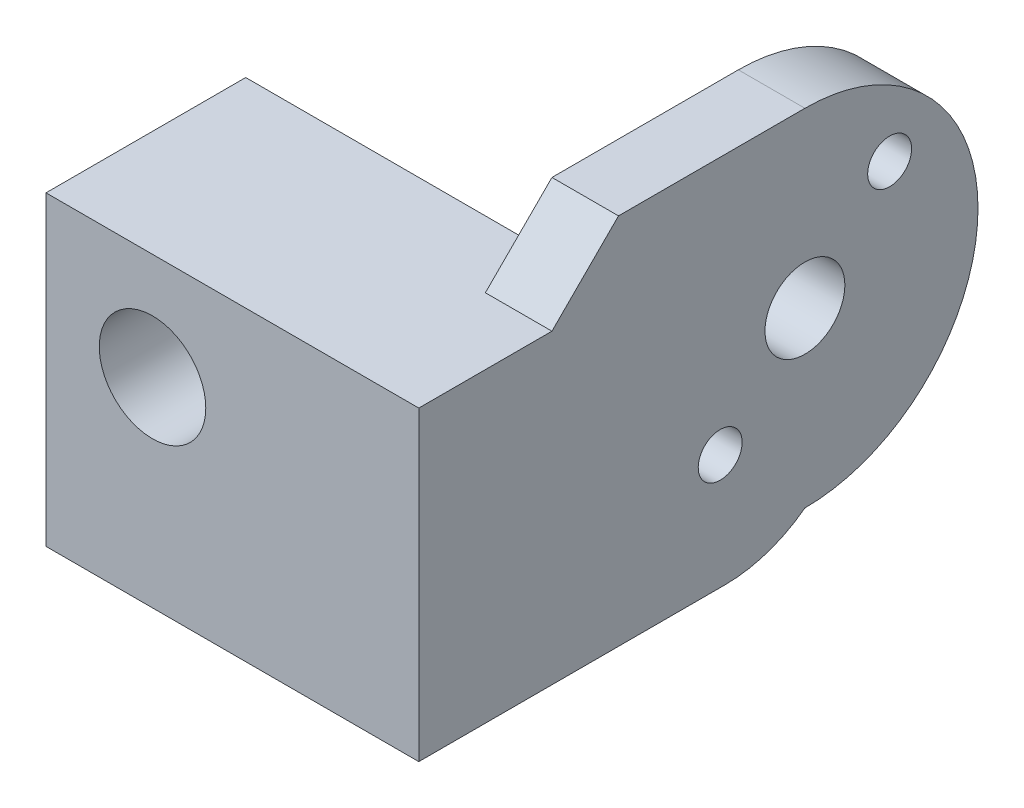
ISO-10303-21;
HEADER;
FILE_DESCRIPTION(('STEP AP214'),'2;1');
FILE_NAME('part.step','',(''),(''),'','','');
FILE_SCHEMA(('AUTOMOTIVE_DESIGN { 1 0 10303 214 1 1 1 1 }'));
ENDSEC;
DATA;
#1=APPLICATION_CONTEXT('core data for automotive mechanical design processes');
#2=APPLICATION_PROTOCOL_DEFINITION('international standard','automotive_design',2000,#1);
#3=PRODUCT_CONTEXT('',#1,'mechanical');
#4=PRODUCT('Part','Part','',(#3));
#5=PRODUCT_RELATED_PRODUCT_CATEGORY('part','',(#4));
#6=PRODUCT_DEFINITION_FORMATION('','',#4);
#7=PRODUCT_DEFINITION_CONTEXT('part definition',#1,'design');
#8=PRODUCT_DEFINITION('design','',#6,#7);
#9=PRODUCT_DEFINITION_SHAPE('','',#8);
#10=(LENGTH_UNIT() NAMED_UNIT(*) SI_UNIT(.MILLI.,.METRE.));
#11=(NAMED_UNIT(*) PLANE_ANGLE_UNIT() SI_UNIT($,.RADIAN.));
#12=(NAMED_UNIT(*) SI_UNIT($,.STERADIAN.) SOLID_ANGLE_UNIT());
#13=UNCERTAINTY_MEASURE_WITH_UNIT(LENGTH_MEASURE(1.E-05),#10,'distance_accuracy_value','');
#14=(GEOMETRIC_REPRESENTATION_CONTEXT(3) GLOBAL_UNCERTAINTY_ASSIGNED_CONTEXT((#13)) GLOBAL_UNIT_ASSIGNED_CONTEXT((#10,
#11,#12)) REPRESENTATION_CONTEXT('',''));
#15=CARTESIAN_POINT('',(0.,0.,0.));
#16=DIRECTION('',(0.,0.,1.));
#17=DIRECTION('',(1.,0.,0.));
#18=AXIS2_PLACEMENT_3D('',#15,#16,#17);
#19=CARTESIAN_POINT('',(0.,0.,-5.));
#20=DIRECTION('',(0.,0.,-1.));
#21=DIRECTION('',(-1.,0.,0.));
#22=AXIS2_PLACEMENT_3D('',#19,#20,#21);
#23=PLANE('',#22);
#24=DIRECTION('',(1.,0.,0.));
#25=VECTOR('',#24,1.);
#26=CARTESIAN_POINT('',(-8.,8.,-5.));
#27=LINE('',#26,#25);
#28=CARTESIAN_POINT('',(-8.,8.,-5.));
#29=VERTEX_POINT('',#28);
#30=CARTESIAN_POINT('',(15.,8.,-5.));
#31=VERTEX_POINT('',#30);
#32=EDGE_CURVE('E161',#29,#31,#27,.T.);
#33=ORIENTED_EDGE('',*,*,#32,.T.);
#34=DIRECTION('',(0.,-1.,0.));
#35=VECTOR('',#34,1.);
#36=CARTESIAN_POINT('',(15.,-15.,-5.));
#37=LINE('',#36,#35);
#38=CARTESIAN_POINT('',(15.,-15.,-5.));
#39=VERTEX_POINT('',#38);
#40=EDGE_CURVE('E147',#31,#39,#37,.T.);
#41=ORIENTED_EDGE('',*,*,#40,.T.);
#42=DIRECTION('',(-1.,0.,0.));
#43=VECTOR('',#42,1.);
#44=CARTESIAN_POINT('',(20.,-15.,-5.));
#45=LINE('',#44,#43);
#46=CARTESIAN_POINT('',(-8.,-15.,-5.));
#47=VERTEX_POINT('',#46);
#48=EDGE_CURVE('E167',#39,#47,#45,.T.);
#49=ORIENTED_EDGE('',*,*,#48,.T.);
#50=DIRECTION('',(0.,1.,0.));
#51=VECTOR('',#50,1.);
#52=CARTESIAN_POINT('',(-8.,-15.,-5.));
#53=LINE('',#52,#51);
#54=EDGE_CURVE('E170',#47,#29,#53,.T.);
#55=ORIENTED_EDGE('',*,*,#54,.T.);
#56=EDGE_LOOP('',(#33,#41,#49,#55));
#57=FACE_BOUND('',#56,.T.);
#58=ADVANCED_FACE('F41',(#57),#23,.T.);
#59=CARTESIAN_POINT('',(0.,0.,10.));
#60=DIRECTION('',(0.,0.,-1.));
#61=DIRECTION('',(-1.,0.,0.));
#62=AXIS2_PLACEMENT_3D('',#59,#60,#61);
#63=PLANE('',#62);
#64=DIRECTION('',(0.,1.,0.));
#65=VECTOR('',#64,1.);
#66=CARTESIAN_POINT('',(20.,8.,10.));
#67=LINE('',#66,#65);
#68=CARTESIAN_POINT('',(20.,-15.,10.));
#69=VERTEX_POINT('',#68);
#70=CARTESIAN_POINT('',(20.,8.,10.));
#71=VERTEX_POINT('',#70);
#72=EDGE_CURVE('E179',#69,#71,#67,.T.);
#73=ORIENTED_EDGE('',*,*,#72,.T.);
#74=DIRECTION('',(-1.,0.,0.));
#75=VECTOR('',#74,1.);
#76=CARTESIAN_POINT('',(20.,8.,10.));
#77=LINE('',#76,#75);
#78=CARTESIAN_POINT('',(-8.,8.,10.));
#79=VERTEX_POINT('',#78);
#80=EDGE_CURVE('E186',#71,#79,#77,.T.);
#81=ORIENTED_EDGE('',*,*,#80,.T.);
#82=DIRECTION('',(0.,-1.,0.));
#83=VECTOR('',#82,1.);
#84=CARTESIAN_POINT('',(-8.,8.,10.));
#85=LINE('',#84,#83);
#86=CARTESIAN_POINT('',(-8.,-15.,10.));
#87=VERTEX_POINT('',#86);
#88=EDGE_CURVE('E189',#79,#87,#85,.T.);
#89=ORIENTED_EDGE('',*,*,#88,.T.);
#90=DIRECTION('',(1.,0.,0.));
#91=VECTOR('',#90,1.);
#92=CARTESIAN_POINT('',(20.,-15.,10.));
#93=LINE('',#92,#91);
#94=EDGE_CURVE('E192',#87,#69,#93,.T.);
#95=ORIENTED_EDGE('',*,*,#94,.T.);
#96=EDGE_LOOP('',(#73,#81,#89,#95));
#97=FACE_BOUND('',#96,.T.);
#98=CARTESIAN_POINT('',(0.,0.,10.));
#99=DIRECTION('',(0.,0.,1.));
#100=DIRECTION('',(1.,0.,0.));
#101=AXIS2_PLACEMENT_3D('',#98,#99,#100);
#102=CIRCLE('',#101,4.);
#103=CARTESIAN_POINT('',(4.,0.,10.));
#104=VERTEX_POINT('',#103);
#105=EDGE_CURVE('E175',#104,#104,#102,.T.);
#106=ORIENTED_EDGE('',*,*,#105,.F.);
#107=EDGE_LOOP('',(#106));
#108=FACE_BOUND('',#107,.T.);
#109=ADVANCED_FACE('F245',(#97,#108),#63,.F.);
#110=CARTESIAN_POINT('',(20.,8.,10.));
#111=DIRECTION('',(-1.,0.,0.));
#112=DIRECTION('',(0.,-1.,0.));
#113=AXIS2_PLACEMENT_3D('',#110,#111,#112);
#114=PLANE('',#113);
#115=CARTESIAN_POINT('',(20.,6.36396103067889,-25.363961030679));
#116=DIRECTION('',(-1.,0.,0.));
#117=DIRECTION('',(0.,-1.,0.));
#118=AXIS2_PLACEMENT_3D('',#115,#116,#117);
#119=CIRCLE('',#118,1.65);
#120=CARTESIAN_POINT('',(20.,4.71396103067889,-25.363961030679));
#121=VERTEX_POINT('',#120);
#122=EDGE_CURVE('E291',#121,#121,#119,.T.);
#123=ORIENTED_EDGE('',*,*,#122,.T.);
#124=EDGE_LOOP('',(#123));
#125=FACE_BOUND('',#124,.T.);
#126=CARTESIAN_POINT('',(20.,-6.3639610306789,-12.636038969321));
#127=DIRECTION('',(-1.,0.,0.));
#128=DIRECTION('',(0.,-1.,0.));
#129=AXIS2_PLACEMENT_3D('',#126,#127,#128);
#130=CIRCLE('',#129,1.65);
#131=CARTESIAN_POINT('',(20.,-8.0139610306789,-12.636038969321));
#132=VERTEX_POINT('',#131);
#133=EDGE_CURVE('E296',#132,#132,#130,.T.);
#134=ORIENTED_EDGE('',*,*,#133,.T.);
#135=EDGE_LOOP('',(#134));
#136=FACE_BOUND('',#135,.T.);
#137=DIRECTION('',(0.,0.,-1.));
#138=VECTOR('',#137,1.);
#139=CARTESIAN_POINT('',(20.,-15.,10.));
#140=LINE('',#139,#138);
#141=CARTESIAN_POINT('',(20.,-15.,-13.));
#142=VERTEX_POINT('',#141);
#143=EDGE_CURVE('E195',#69,#142,#140,.T.);
#144=ORIENTED_EDGE('',*,*,#143,.T.);
#145=CARTESIAN_POINT('',(20.,-5.,-13.));
#146=DIRECTION('',(-1.,0.,0.));
#147=DIRECTION('',(0.,-1.,0.));
#148=AXIS2_PLACEMENT_3D('',#145,#146,#147);
#149=CIRCLE('',#148,10.);
#150=CARTESIAN_POINT('',(20.,-13.,-19.));
#151=VERTEX_POINT('',#150);
#152=EDGE_CURVE('E211',#142,#151,#149,.F.);
#153=ORIENTED_EDGE('',*,*,#152,.T.);
#154=CARTESIAN_POINT('',(20.,0.,-19.));
#155=DIRECTION('',(1.,0.,0.));
#156=DIRECTION('',(0.,-1.,0.));
#157=AXIS2_PLACEMENT_3D('',#154,#155,#156);
#158=CIRCLE('',#157,13.);
#159=CARTESIAN_POINT('',(20.,13.,-19.));
#160=VERTEX_POINT('',#159);
#161=EDGE_CURVE('E141',#151,#160,#158,.T.);
#162=ORIENTED_EDGE('',*,*,#161,.T.);
#163=DIRECTION('',(0.,0.,1.));
#164=VECTOR('',#163,1.);
#165=CARTESIAN_POINT('',(20.,13.,-5.));
#166=LINE('',#165,#164);
#167=CARTESIAN_POINT('',(20.,13.,-5.));
#168=VERTEX_POINT('',#167);
#169=EDGE_CURVE('E119',#160,#168,#166,.T.);
#170=ORIENTED_EDGE('',*,*,#169,.T.);
#171=DIRECTION('',(0.,-0.707106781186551,0.707106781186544));
#172=VECTOR('',#171,1.);
#173=CARTESIAN_POINT('',(20.,2.99999999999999,4.99999999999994));
#174=LINE('',#173,#172);
#175=CARTESIAN_POINT('',(20.,8.,0.));
#176=VERTEX_POINT('',#175);
#177=EDGE_CURVE('E51',#168,#176,#174,.T.);
#178=ORIENTED_EDGE('',*,*,#177,.T.);
#179=DIRECTION('',(0.,0.,-1.));
#180=VECTOR('',#179,1.);
#181=CARTESIAN_POINT('',(20.,8.,10.));
#182=LINE('',#181,#180);
#183=EDGE_CURVE('E152',#71,#176,#182,.T.);
#184=ORIENTED_EDGE('',*,*,#183,.F.);
#185=ORIENTED_EDGE('',*,*,#72,.F.);
#186=EDGE_LOOP('',(#144,#153,#162,#170,#178,#184,#185));
#187=FACE_BOUND('',#186,.T.);
#188=CARTESIAN_POINT('',(20.,0.,-19.));
#189=DIRECTION('',(1.,0.,0.));
#190=DIRECTION('',(0.,1.,0.));
#191=AXIS2_PLACEMENT_3D('',#188,#189,#190);
#192=CIRCLE('',#191,3.);
#193=CARTESIAN_POINT('',(20.,3.,-19.));
#194=VERTEX_POINT('',#193);
#195=EDGE_CURVE('E144',#194,#194,#192,.T.);
#196=ORIENTED_EDGE('',*,*,#195,.F.);
#197=EDGE_LOOP('',(#196));
#198=FACE_BOUND('',#197,.T.);
#199=ADVANCED_FACE('F227',(#125,#136,#187,#198),#114,.F.);
#200=CARTESIAN_POINT('',(20.,8.,10.));
#201=DIRECTION('',(0.,-1.,0.));
#202=DIRECTION('',(1.,0.,0.));
#203=AXIS2_PLACEMENT_3D('',#200,#201,#202);
#204=PLANE('',#203);
#205=ORIENTED_EDGE('',*,*,#183,.T.);
#206=DIRECTION('',(-1.,0.,0.));
#207=VECTOR('',#206,1.);
#208=CARTESIAN_POINT('',(20.,8.,0.));
#209=LINE('',#208,#207);
#210=CARTESIAN_POINT('',(15.,8.,0.));
#211=VERTEX_POINT('',#210);
#212=EDGE_CURVE('E219',#176,#211,#209,.T.);
#213=ORIENTED_EDGE('',*,*,#212,.T.);
#214=DIRECTION('',(0.,0.,-1.));
#215=VECTOR('',#214,1.);
#216=CARTESIAN_POINT('',(15.,8.,10.));
#217=LINE('',#216,#215);
#218=EDGE_CURVE('E57',#211,#31,#217,.T.);
#219=ORIENTED_EDGE('',*,*,#218,.T.);
#220=ORIENTED_EDGE('',*,*,#32,.F.);
#221=DIRECTION('',(0.,0.,-1.));
#222=VECTOR('',#221,1.);
#223=CARTESIAN_POINT('',(-8.,8.,10.));
#224=LINE('',#223,#222);
#225=EDGE_CURVE('E203',#79,#29,#224,.T.);
#226=ORIENTED_EDGE('',*,*,#225,.F.);
#227=ORIENTED_EDGE('',*,*,#80,.F.);
#228=EDGE_LOOP('',(#205,#213,#219,#220,#226,#227));
#229=FACE_BOUND('',#228,.T.);
#230=ADVANCED_FACE('F224',(#229),#204,.F.);
#231=CARTESIAN_POINT('',(-8.,8.,10.));
#232=DIRECTION('',(1.,0.,0.));
#233=DIRECTION('',(0.,1.,0.));
#234=AXIS2_PLACEMENT_3D('',#231,#232,#233);
#235=PLANE('',#234);
#236=ORIENTED_EDGE('',*,*,#225,.T.);
#237=ORIENTED_EDGE('',*,*,#54,.F.);
#238=DIRECTION('',(0.,0.,-1.));
#239=VECTOR('',#238,1.);
#240=CARTESIAN_POINT('',(-8.,-15.,10.));
#241=LINE('',#240,#239);
#242=EDGE_CURVE('E199',#87,#47,#241,.T.);
#243=ORIENTED_EDGE('',*,*,#242,.F.);
#244=ORIENTED_EDGE('',*,*,#88,.F.);
#245=EDGE_LOOP('',(#236,#237,#243,#244));
#246=FACE_BOUND('',#245,.T.);
#247=ADVANCED_FACE('F243',(#246),#235,.F.);
#248=CARTESIAN_POINT('',(20.,-15.,10.));
#249=DIRECTION('',(0.,1.,0.));
#250=DIRECTION('',(-1.,0.,0.));
#251=AXIS2_PLACEMENT_3D('',#248,#249,#250);
#252=PLANE('',#251);
#253=DIRECTION('',(0.,0.,-1.));
#254=VECTOR('',#253,1.);
#255=CARTESIAN_POINT('',(15.,-15.,-19.));
#256=LINE('',#255,#254);
#257=CARTESIAN_POINT('',(15.,-15.,-13.));
#258=VERTEX_POINT('',#257);
#259=EDGE_CURVE('E126',#39,#258,#256,.T.);
#260=ORIENTED_EDGE('',*,*,#259,.T.);
#261=DIRECTION('',(1.,0.,0.));
#262=VECTOR('',#261,1.);
#263=CARTESIAN_POINT('',(20.,-15.,-13.));
#264=LINE('',#263,#262);
#265=EDGE_CURVE('E151',#258,#142,#264,.T.);
#266=ORIENTED_EDGE('',*,*,#265,.T.);
#267=ORIENTED_EDGE('',*,*,#143,.F.);
#268=ORIENTED_EDGE('',*,*,#94,.F.);
#269=ORIENTED_EDGE('',*,*,#242,.T.);
#270=ORIENTED_EDGE('',*,*,#48,.F.);
#271=EDGE_LOOP('',(#260,#266,#267,#268,#269,#270));
#272=FACE_BOUND('',#271,.T.);
#273=ADVANCED_FACE('F234',(#272),#252,.F.);
#274=CARTESIAN_POINT('',(0.,0.,10.));
#275=DIRECTION('',(0.,0.,-1.));
#276=DIRECTION('',(-1.,0.,0.));
#277=AXIS2_PLACEMENT_3D('',#274,#275,#276);
#278=CYLINDRICAL_SURFACE('',#277,4.);
#279=ORIENTED_EDGE('',*,*,#105,.T.);
#280=EDGE_LOOP('',(#279));
#281=FACE_BOUND('',#280,.T.);
#282=CARTESIAN_POINT('',(0.,0.,0.));
#283=DIRECTION('',(0.,0.,1.));
#284=DIRECTION('',(1.,0.,0.));
#285=AXIS2_PLACEMENT_3D('',#282,#283,#284);
#286=CIRCLE('',#285,4.);
#287=CARTESIAN_POINT('',(4.,0.,0.));
#288=VERTEX_POINT('',#287);
#289=EDGE_CURVE('E174',#288,#288,#286,.T.);
#290=ORIENTED_EDGE('',*,*,#289,.F.);
#291=EDGE_LOOP('',(#290));
#292=FACE_BOUND('',#291,.T.);
#293=ADVANCED_FACE('F252',(#281,#292),#278,.F.);
#294=CARTESIAN_POINT('',(0.,0.,0.));
#295=DIRECTION('',(0.,0.,-1.));
#296=DIRECTION('',(-1.,0.,0.));
#297=AXIS2_PLACEMENT_3D('',#294,#295,#296);
#298=PLANE('',#297);
#299=ORIENTED_EDGE('',*,*,#289,.T.);
#300=EDGE_LOOP('',(#299));
#301=FACE_BOUND('',#300,.T.);
#302=ADVANCED_FACE('F255',(#301),#298,.F.);
#303=CARTESIAN_POINT('',(15.,0.,-19.));
#304=DIRECTION('',(1.,0.,0.));
#305=DIRECTION('',(0.,1.,0.));
#306=AXIS2_PLACEMENT_3D('',#303,#304,#305);
#307=CYLINDRICAL_SURFACE('',#306,13.);
#308=ORIENTED_EDGE('',*,*,#161,.F.);
#309=DIRECTION('',(1.,0.,0.));
#310=VECTOR('',#309,1.);
#311=CARTESIAN_POINT('',(15.,-13.,-19.));
#312=LINE('',#311,#310);
#313=CARTESIAN_POINT('',(15.,-13.,-19.));
#314=VERTEX_POINT('',#313);
#315=EDGE_CURVE('E137',#314,#151,#312,.T.);
#316=ORIENTED_EDGE('',*,*,#315,.F.);
#317=CARTESIAN_POINT('',(15.,0.,-19.));
#318=DIRECTION('',(1.,0.,0.));
#319=DIRECTION('',(0.,-1.,0.));
#320=AXIS2_PLACEMENT_3D('',#317,#318,#319);
#321=CIRCLE('',#320,13.);
#322=CARTESIAN_POINT('',(15.,13.,-19.));
#323=VERTEX_POINT('',#322);
#324=EDGE_CURVE('E130',#314,#323,#321,.T.);
#325=ORIENTED_EDGE('',*,*,#324,.T.);
#326=DIRECTION('',(1.,0.,0.));
#327=VECTOR('',#326,1.);
#328=CARTESIAN_POINT('',(15.,13.,-19.));
#329=LINE('',#328,#327);
#330=EDGE_CURVE('E113',#323,#160,#329,.T.);
#331=ORIENTED_EDGE('',*,*,#330,.T.);
#332=EDGE_LOOP('',(#308,#316,#325,#331));
#333=FACE_BOUND('',#332,.T.);
#334=ADVANCED_FACE('F135',(#333),#307,.T.);
#335=CARTESIAN_POINT('',(15.,13.,-5.));
#336=DIRECTION('',(0.,1.,0.));
#337=DIRECTION('',(-1.,0.,0.));
#338=AXIS2_PLACEMENT_3D('',#335,#336,#337);
#339=PLANE('',#338);
#340=ORIENTED_EDGE('',*,*,#169,.F.);
#341=ORIENTED_EDGE('',*,*,#330,.F.);
#342=DIRECTION('',(0.,0.,1.));
#343=VECTOR('',#342,1.);
#344=CARTESIAN_POINT('',(15.,13.,-5.));
#345=LINE('',#344,#343);
#346=CARTESIAN_POINT('',(15.,13.,-5.));
#347=VERTEX_POINT('',#346);
#348=EDGE_CURVE('E117',#323,#347,#345,.T.);
#349=ORIENTED_EDGE('',*,*,#348,.T.);
#350=DIRECTION('',(1.,0.,0.));
#351=VECTOR('',#350,1.);
#352=CARTESIAN_POINT('',(15.,13.,-5.));
#353=LINE('',#352,#351);
#354=EDGE_CURVE('E125',#347,#168,#353,.T.);
#355=ORIENTED_EDGE('',*,*,#354,.T.);
#356=EDGE_LOOP('',(#340,#341,#349,#355));
#357=FACE_BOUND('',#356,.T.);
#358=ADVANCED_FACE('F115',(#357),#339,.T.);
#359=CARTESIAN_POINT('',(15.,0.,-19.));
#360=DIRECTION('',(-1.,0.,0.));
#361=DIRECTION('',(0.,-1.,0.));
#362=AXIS2_PLACEMENT_3D('',#359,#360,#361);
#363=PLANE('',#362);
#364=CARTESIAN_POINT('',(15.,6.36396103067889,-25.363961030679));
#365=DIRECTION('',(-1.,0.,0.));
#366=DIRECTION('',(0.,-1.,0.));
#367=AXIS2_PLACEMENT_3D('',#364,#365,#366);
#368=CIRCLE('',#367,1.65);
#369=CARTESIAN_POINT('',(15.,4.71396103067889,-25.363961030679));
#370=VERTEX_POINT('',#369);
#371=EDGE_CURVE('E294',#370,#370,#368,.T.);
#372=ORIENTED_EDGE('',*,*,#371,.F.);
#373=EDGE_LOOP('',(#372));
#374=FACE_BOUND('',#373,.T.);
#375=CARTESIAN_POINT('',(15.,-6.36396103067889,-12.636038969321));
#376=DIRECTION('',(-1.,0.,0.));
#377=DIRECTION('',(0.,-1.,0.));
#378=AXIS2_PLACEMENT_3D('',#375,#376,#377);
#379=CIRCLE('',#378,1.65);
#380=CARTESIAN_POINT('',(15.,-8.0139610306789,-12.636038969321));
#381=VERTEX_POINT('',#380);
#382=EDGE_CURVE('E302',#381,#381,#379,.T.);
#383=ORIENTED_EDGE('',*,*,#382,.F.);
#384=EDGE_LOOP('',(#383));
#385=FACE_BOUND('',#384,.T.);
#386=CARTESIAN_POINT('',(15.,0.,-19.));
#387=DIRECTION('',(1.,0.,0.));
#388=DIRECTION('',(0.,1.,0.));
#389=AXIS2_PLACEMENT_3D('',#386,#387,#388);
#390=CIRCLE('',#389,3.);
#391=CARTESIAN_POINT('',(15.,3.,-19.));
#392=VERTEX_POINT('',#391);
#393=EDGE_CURVE('E157',#392,#392,#390,.T.);
#394=ORIENTED_EDGE('',*,*,#393,.T.);
#395=EDGE_LOOP('',(#394));
#396=FACE_BOUND('',#395,.T.);
#397=ORIENTED_EDGE('',*,*,#324,.F.);
#398=CARTESIAN_POINT('',(15.,-5.,-13.));
#399=DIRECTION('',(-1.,0.,0.));
#400=DIRECTION('',(0.,-1.,0.));
#401=AXIS2_PLACEMENT_3D('',#398,#399,#400);
#402=CIRCLE('',#401,10.);
#403=EDGE_CURVE('E214',#314,#258,#402,.T.);
#404=ORIENTED_EDGE('',*,*,#403,.T.);
#405=ORIENTED_EDGE('',*,*,#259,.F.);
#406=ORIENTED_EDGE('',*,*,#40,.F.);
#407=ORIENTED_EDGE('',*,*,#218,.F.);
#408=DIRECTION('',(0.,0.707106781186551,-0.707106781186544));
#409=VECTOR('',#408,1.);
#410=CARTESIAN_POINT('',(15.,13.,-5.));
#411=LINE('',#410,#409);
#412=EDGE_CURVE('E11',#211,#347,#411,.T.);
#413=ORIENTED_EDGE('',*,*,#412,.T.);
#414=ORIENTED_EDGE('',*,*,#348,.F.);
#415=EDGE_LOOP('',(#397,#404,#405,#406,#407,#413,#414));
#416=FACE_BOUND('',#415,.T.);
#417=ADVANCED_FACE('F129',(#374,#385,#396,#416),#363,.T.);
#418=CARTESIAN_POINT('',(15.,0.,-19.));
#419=DIRECTION('',(1.,0.,0.));
#420=DIRECTION('',(0.,1.,0.));
#421=AXIS2_PLACEMENT_3D('',#418,#419,#420);
#422=CYLINDRICAL_SURFACE('',#421,3.);
#423=ORIENTED_EDGE('',*,*,#393,.F.);
#424=EDGE_LOOP('',(#423));
#425=FACE_BOUND('',#424,.T.);
#426=ORIENTED_EDGE('',*,*,#195,.T.);
#427=EDGE_LOOP('',(#426));
#428=FACE_BOUND('',#427,.T.);
#429=ADVANCED_FACE('F274',(#425,#428),#422,.F.);
#430=CARTESIAN_POINT('',(15.,-5.,-13.));
#431=DIRECTION('',(1.,0.,0.));
#432=DIRECTION('',(0.,1.,0.));
#433=AXIS2_PLACEMENT_3D('',#430,#431,#432);
#434=CYLINDRICAL_SURFACE('',#433,10.);
#435=ORIENTED_EDGE('',*,*,#403,.F.);
#436=ORIENTED_EDGE('',*,*,#315,.T.);
#437=ORIENTED_EDGE('',*,*,#152,.F.);
#438=ORIENTED_EDGE('',*,*,#265,.F.);
#439=EDGE_LOOP('',(#435,#436,#437,#438));
#440=FACE_BOUND('',#439,.T.);
#441=ADVANCED_FACE('F230',(#440),#434,.T.);
#442=CARTESIAN_POINT('',(15.,13.,-5.));
#443=DIRECTION('',(0.,-0.707106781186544,-0.707106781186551));
#444=DIRECTION('',(1.,0.,0.));
#445=AXIS2_PLACEMENT_3D('',#442,#443,#444);
#446=PLANE('',#445);
#447=ORIENTED_EDGE('',*,*,#412,.F.);
#448=ORIENTED_EDGE('',*,*,#212,.F.);
#449=ORIENTED_EDGE('',*,*,#177,.F.);
#450=ORIENTED_EDGE('',*,*,#354,.F.);
#451=EDGE_LOOP('',(#447,#448,#449,#450));
#452=FACE_BOUND('',#451,.T.);
#453=ADVANCED_FACE('F44',(#452),#446,.F.);
#454=CARTESIAN_POINT('',(20.,-6.3639610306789,-12.636038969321));
#455=DIRECTION('',(-1.,0.,0.));
#456=DIRECTION('',(0.,-1.,0.));
#457=AXIS2_PLACEMENT_3D('',#454,#455,#456);
#458=CYLINDRICAL_SURFACE('',#457,1.65);
#459=ORIENTED_EDGE('',*,*,#133,.F.);
#460=EDGE_LOOP('',(#459));
#461=FACE_BOUND('',#460,.T.);
#462=ORIENTED_EDGE('',*,*,#382,.T.);
#463=EDGE_LOOP('',(#462));
#464=FACE_BOUND('',#463,.T.);
#465=ADVANCED_FACE('F279',(#461,#464),#458,.F.);
#466=CARTESIAN_POINT('',(20.,6.36396103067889,-25.363961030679));
#467=DIRECTION('',(-1.,0.,0.));
#468=DIRECTION('',(0.,-1.,0.));
#469=AXIS2_PLACEMENT_3D('',#466,#467,#468);
#470=CYLINDRICAL_SURFACE('',#469,1.65);
#471=ORIENTED_EDGE('',*,*,#122,.F.);
#472=EDGE_LOOP('',(#471));
#473=FACE_BOUND('',#472,.T.);
#474=ORIENTED_EDGE('',*,*,#371,.T.);
#475=EDGE_LOOP('',(#474));
#476=FACE_BOUND('',#475,.T.);
#477=ADVANCED_FACE('F282',(#473,#476),#470,.F.);
#478=CLOSED_SHELL('',(#58,#109,#199,#230,#247,#273,#293,#302,#334,#358,#417,#429,#441,#453,#465,#477));
#479=MANIFOLD_SOLID_BREP('B2',#478);
#480=ADVANCED_BREP_SHAPE_REPRESENTATION('',(#18,#479),#14);
#481=SHAPE_DEFINITION_REPRESENTATION(#9,#480);
ENDSEC;
END-ISO-10303-21;
